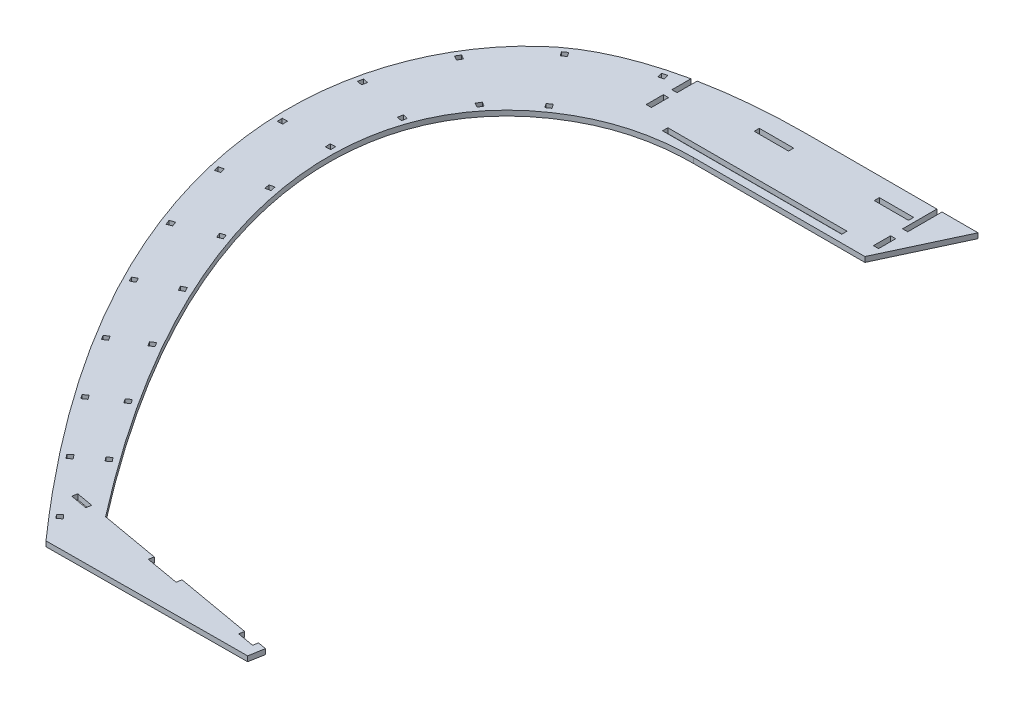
from build123d import *

# Parameters (mm, degrees)
BOSS_EXTRUDE1_DEPTH = 3
CUT_EXTRUDE1_DEPTH  = 10
SKETCH4_W           = 20
SKETCH4_H           = 3
SKETCH4_W_2         = 3
SKETCH4_H_2         = 10
CUT_EXTRUDE2_DEPTH  = 10
SKETCH5_W           = 104.544462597
SKETCH5_H           = 3.1
CUT_EXTRUDE3_DEPTH  = 3
CUT_EXTRUDE4_DEPTH  = 3
SKETCH7_W           = 3
SKETCH7_H           = 20
SKETCH7_H_2         = 17
CUT_EXTRUDE5_DEPTH  = 3


with BuildPart() as part:
    # Sketch2 → Boss-Extrude1 (new body)
    with BuildSketch(Plane(origin=(0, 0, 0), x_dir=(1, 0, 0), z_dir=(0, 1, 0))):
        with BuildLine():
            Line((10, -352.906629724), (123.252891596, -372.876170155))
            Line((123.252891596, -372.876170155), (121.690057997, -381.739439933))
            Line((121.690057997, -381.739439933), (4.79055467, -382.450862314))
            add(Edge.make_bspline(
                [(20.983844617, 45), (-20.255835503, 45), (-69.132572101, 35.883633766), (-141.876241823, -17.410566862), (-193.805450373, -157.847374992), (4.79055467, -382.450862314)],
                knots=[0, 0, 0, 0, 0.294228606, 0.394228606, 1, 1, 1, 1], degree=3))
            Line((20.983844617, 45), (120.983844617, 45))
            Line((120.983844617, 45), (100, 0))
            Line((100, 0), (0, 0))
            add(Edge.make_bspline(
                [(0, 0), (-24.996037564, 0), (-123.905614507, -31.964498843), (-137.328075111, -162.573834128), (10, -352.906629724)],
                knots=[0, 0, 0, 0, 0.19747172, 1, 1, 1, 1], degree=3))
        make_face()
    extrude(amount=BOSS_EXTRUDE1_DEPTH)

    # Sketch3 → Cut-Extrude1 (cut)
    with BuildSketch(Plane(origin=(0, 0, 0), x_dir=(1, 0, 0), z_dir=(0, 1, 0))):
        Polygon((-51.912943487, 33.231946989), (-49.016155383, 34.012087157), (-48.236015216, 31.115299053), (-51.132803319, 30.335158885), align=None)
        Polygon((-89.504250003, 16.717935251), (-91.949424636, 14.979798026), (-90.211287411, 12.534623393), (-87.766112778, 14.272760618), align=None)
        Polygon((-120.966264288, -18.338883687), (-119.427260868, -15.763719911), (-116.852097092, -17.302723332), (-118.391100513, -19.877887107), align=None)
        Polygon((-135.856865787, -56.501754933), (-136.498633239, -59.43230685), (-133.568081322, -60.074074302), (-132.92631387, -57.143522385), align=None)
        Polygon((-139.801585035, -100.065742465), (-139.678804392, -103.063228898), (-136.68131796, -102.940448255), (-136.804098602, -99.942961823), align=None)
        Polygon((-133.975226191, -143.228562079), (-133.28939583, -146.149116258), (-130.36884165, -145.463285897), (-131.054672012, -142.542731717), align=None)
        Polygon((-121.203095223, -184.715121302), (-120.120282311, -187.512891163), (-117.322512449, -186.43007825), (-118.405325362, -183.632308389), align=None)
        Polygon((-103.554049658, -224.261561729), (-102.188203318, -226.932603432), (-99.517161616, -225.566757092), (-100.883007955, -222.895715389), align=None)
        Polygon((-82.397756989, -261.967940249), (-80.824049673, -264.522043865), (-78.269946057, -262.948336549), (-79.843653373, -260.394232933), align=None)
        Polygon((-58.635070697, -298.030040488), (-56.903851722, -300.480118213), (-54.453773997, -298.748899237), (-56.184992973, -296.298821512), align=None)
        Polygon((-32.873714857, -332.64900383), (-31.019625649, -335.007467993), (-28.661161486, -333.153378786), (-30.515250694, -330.794914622), align=None)
        Polygon((-5.535998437, -366.003873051), (-3.583597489, -368.281619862), (-1.305850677, -366.329218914), (-3.258251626, -364.051472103), align=None)
        Polygon((-67.828539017, -13.949495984), (-70.283842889, -15.673294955), (-68.560043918, -18.128598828), (-66.104740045, -16.404799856), align=None)
        Polygon((-91.130072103, -36.169983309), (-89.591068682, -33.594819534), (-87.015904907, -35.133822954), (-88.554908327, -37.70898673), align=None)
        Polygon((-106.115028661, -63.014979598), (-106.756796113, -65.945531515), (-103.826244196, -66.587298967), (-103.184476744, -63.65674705), align=None)
        Polygon((-112.88251727, -98.963105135), (-112.759736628, -101.960591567), (-109.762250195, -101.837810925), (-109.885030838, -98.840324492), align=None)
        Polygon((-110.074574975, -137.615999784), (-109.388744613, -140.536553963), (-106.468190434, -139.850723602), (-107.154020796, -136.930169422), align=None)
        Polygon((-99.939010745, -176.48534316), (-98.856197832, -179.283113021), (-96.058427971, -178.200300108), (-97.141240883, -175.402530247), align=None)
        Polygon((-84.618255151, -214.578678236), (-83.252408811, -217.249719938), (-80.581367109, -215.883873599), (-81.947213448, -213.212831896), align=None)
        Polygon((-65.608885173, -251.623500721), (-64.035177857, -254.177604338), (-61.481074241, -252.603897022), (-63.054781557, -250.049793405), align=None)
        Polygon((-43.890119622, -287.611293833), (-42.158900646, -290.061371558), (-39.708822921, -288.330152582), (-41.440041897, -285.880074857), align=None)
        Polygon((-20.112117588, -322.616568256), (-18.25802838, -324.975032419), (-15.899564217, -323.120943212), (-17.753653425, -320.762479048), align=None)
    extrude(amount=CUT_EXTRUDE1_DEPTH, mode=Mode.SUBTRACT)

    # Sketch4 → Cut-Extrude2 (cut)
    with BuildSketch(Plane(origin=(0, 0, 0), x_dir=(1, 0, 0), z_dir=(0, 1, 0))):
        with Locations((84.455537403, 32.5)):
            Rectangle(SKETCH4_W, SKETCH4_H)
        with Locations((14.455537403, 32.5)):
            Rectangle(SKETCH4_W, SKETCH4_H)
        with Locations((98.5, 13)):
            Rectangle(SKETCH4_W_2, SKETCH4_H_2)
        with Locations((-39.044462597, 18)):
            Rectangle(SKETCH4_W_2, SKETCH4_H_2)
    extrude(amount=CUT_EXTRUDE2_DEPTH, mode=Mode.SUBTRACT)

    # Sketch5 → Cut-Extrude3 (cut)
    with BuildSketch(Plane(origin=(0, 0, 0), x_dir=(1, 0, 0), z_dir=(0, 1, 0))):
        with Locations((29.727768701, 6.05)):
            Rectangle(SKETCH5_W, SKETCH5_H)
    extrude(amount=CUT_EXTRUDE3_DEPTH, mode=Mode.SUBTRACT)

    # Sketch6 → Cut-Extrude4 (cut)
    with BuildSketch(Plane(origin=(0, 0, 0), x_dir=(1, 0, 0), z_dir=(0, 1, 0))):
        Polygon((118.328852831, -372.007929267), (108.480775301, -370.27144749), (107.959830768, -373.225870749), (117.807908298, -374.962352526), align=None)
        Polygon((-10.217099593, -352.388089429), (-9.69615506, -349.43366617), (0.15192247, -351.170147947), (-0.369022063, -354.124571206), align=None)
        Polygon((43.947326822, -361.938739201), (63.643481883, -365.411702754), (64.164426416, -362.457279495), (44.468271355, -358.984315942), align=None)
    extrude(amount=CUT_EXTRUDE4_DEPTH, mode=Mode.SUBTRACT)

    # Sketch7 → Cut-Extrude5 (cut)
    with BuildSketch(Plane(origin=(0, 0, 0), x_dir=(1, 0, 0), z_dir=(0, 1, 0))):
        with Locations((98.5, 35)):
            Rectangle(SKETCH7_W, SKETCH7_H)
        with Locations((-39.044462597, 36.5)):
            Rectangle(SKETCH7_W, SKETCH7_H_2)
    extrude(amount=CUT_EXTRUDE5_DEPTH, mode=Mode.SUBTRACT)


solid = part.part
